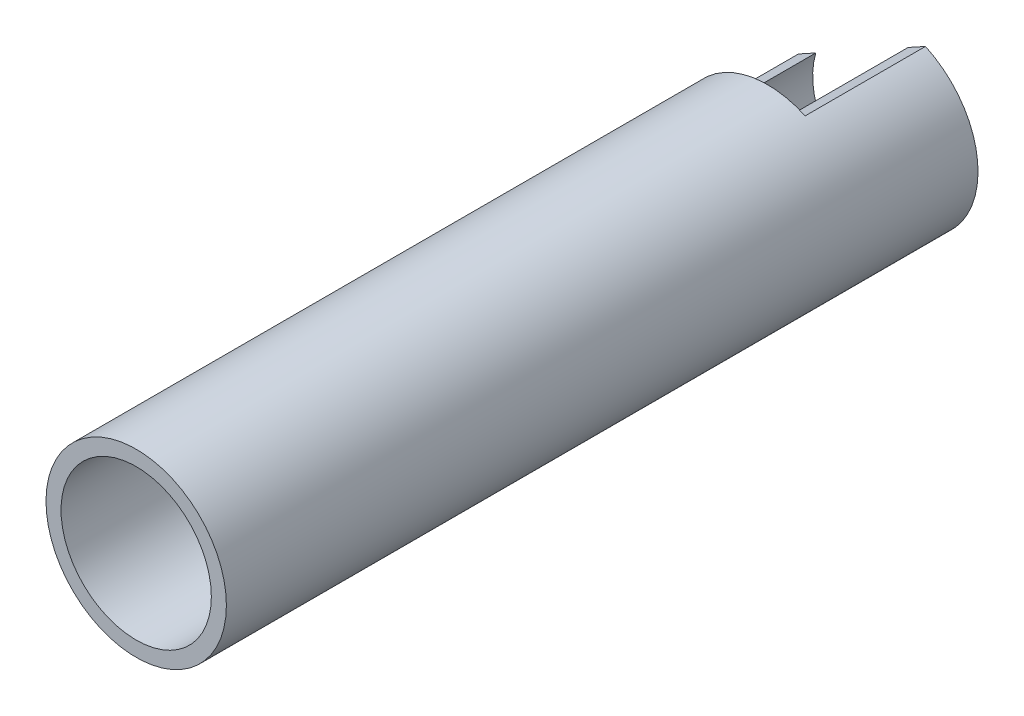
from build123d import *

# Parameters (mm, degrees)
SKETCH1_R           = 60
SKETCH1_R_2         = 50
BOSS_EXTRUDE1_DEPTH = 500
SKETCH2_W           = 100
SKETCH2_H           = 80
CUT_EXTRUDE1_DEPTH  = 30


with BuildPart() as part:
    # Sketch1 → Boss-Extrude1 (new body)
    with BuildSketch(Plane.XY):
        Circle(SKETCH1_R)
        Circle(SKETCH1_R_2, mode=Mode.SUBTRACT)
    extrude(amount=BOSS_EXTRUDE1_DEPTH)

    # Sketch2 → Cut-Extrude1 (cut)
    with BuildSketch(Plane(origin=(-31.706165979, 57.496701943, 0), x_dir=(0.8756817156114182, 0.48288873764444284, 0), z_dir=(-0.4828887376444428, 0.875681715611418, 0))):
        with Locations((0, -40)):
            Rectangle(SKETCH2_W, SKETCH2_H)
    extrude(amount=-CUT_EXTRUDE1_DEPTH, mode=Mode.SUBTRACT)


solid = part.part
